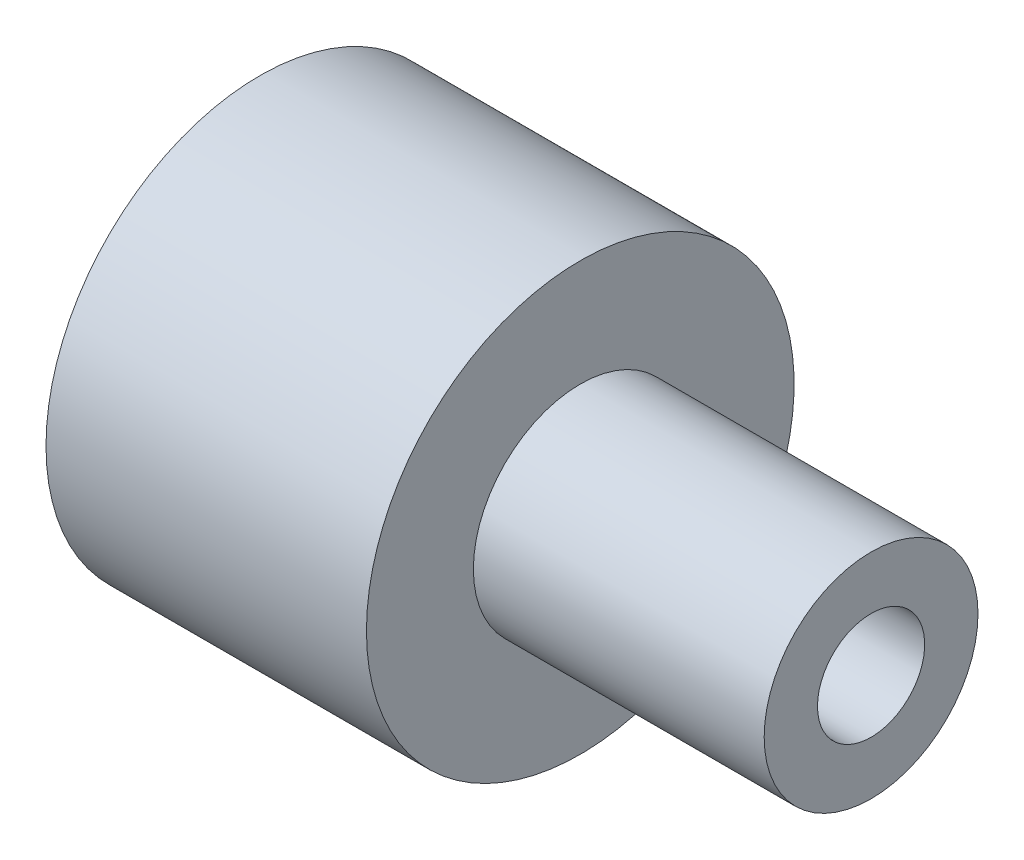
from build123d import *


with BuildPart() as part:
    # Sketch2 → Revolve1 (revolve)
    with BuildSketch(Plane.XY, mode=Mode.PRIVATE) as revolve1_sk:
        Polygon((12.192, 3.9624), (0, 3.9624), (0, 9.525), (14.2748, 9.525), (14.2748, 4.7625), (27.2288, 4.7625), (27.2288, 2.3876), (13.560952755, 2.3876), align=None)
    revolve(revolve1_sk.sketch.rotate(Axis((0, 0, 0), (1, 0, 0)), 90), axis=Axis((0, 0, 0), (1, 0, 0)))


solid = part.part
